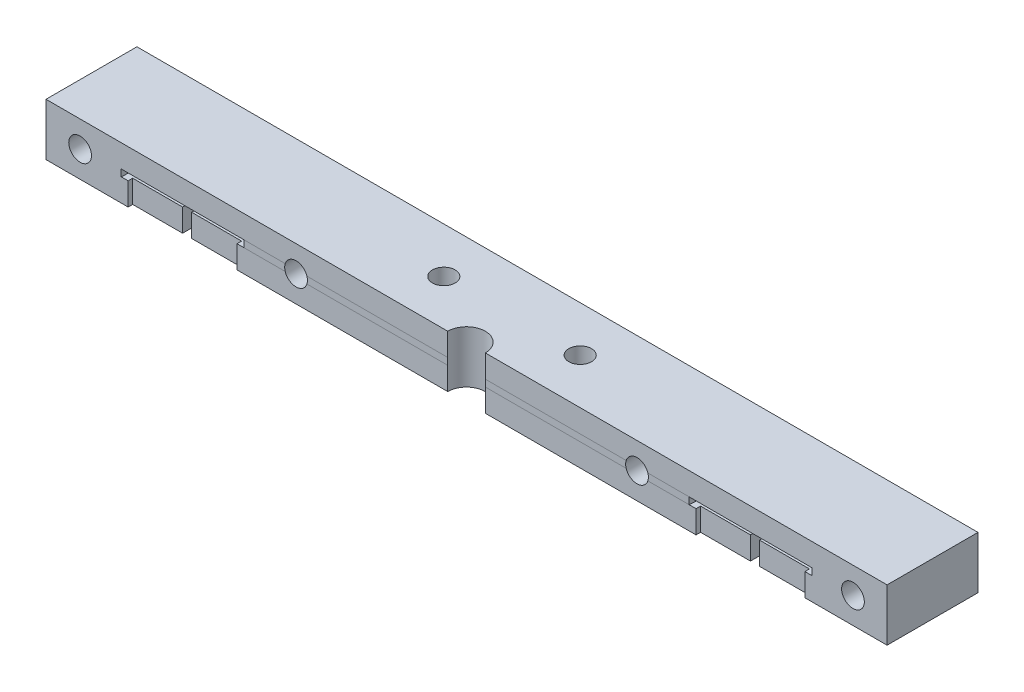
from build123d import *

# Parameters (mm, degrees)
BOSS_EXTRUDE1_DEPTH = 6.35
BOSS_EXTRUDE2_DEPTH = 1.905
SKETCH3_W           = 234.95
SKETCH3_H           = 25.4
BOSS_EXTRUDE4_DEPTH = 6.35
SKETCH4_R           = 3.175
CUT_EXTRUDE1_DEPTH  = 1183.689932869
SKETCH5_R           = 5.25
CUT_EXTRUDE2_DEPTH  = 1412.284370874
SKETCH8_R           = 3.175
CUT_EXTRUDE4_DEPTH  = 1183.68993125
SKETCH9_R           = 3.175
CUT_EXTRUDE5_DEPTH  = 1412.284302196


with BuildPart() as part:
    # Sketch1 → Boss-Extrude1 (new body)
    with BuildSketch(Plane.XZ.offset(-1022.109723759)):
        Polygon((368.049943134, 1286.487114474), (368.049943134, 1285.217114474), (381.988193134, 1285.217114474), (381.988193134, 1271.278864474), (384.528193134, 1271.278864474), (384.528193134, 1285.217114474), (398.466443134, 1285.217114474), (398.466443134, 1286.487114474), (462.575693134, 1286.488034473), (526.684943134, 1286.487114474), (526.684943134, 1285.217114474), (540.623193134, 1285.217114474), (540.623193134, 1271.278864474), (543.163193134, 1271.278864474), (543.163193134, 1285.217114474), (557.101443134, 1285.217114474), (557.101443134, 1286.487114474), (580.050693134, 1286.487114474), (580.050693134, 1261.087114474), (345.100693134, 1261.087114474), (345.100693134, 1286.487114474), align=None)
    extrude(amount=BOSS_EXTRUDE1_DEPTH)

    # Sketch2 → Boss-Extrude2 (add)
    with BuildSketch(Plane(origin=(0, 1022.109723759, 0), x_dir=(1, 0, 0), z_dir=(0, 1, 0))):
        with BuildLine():
            Line((366.113193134, -1286.487114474), (345.100693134, -1286.487114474))
            Line((345.100693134, -1286.487114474), (345.100693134, -1261.087114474))
            Line((345.100693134, -1261.087114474), (580.050693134, -1261.087114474))
            Line((580.050693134, -1261.087114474), (580.050693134, -1286.487114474))
            Line((580.050693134, -1286.487114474), (559.038193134, -1286.487114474))
            ThreePointArc((559.038193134, -1286.487114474), (541.893193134, -1269.342114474), (524.748193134, -1286.487114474))
            Line((524.748193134, -1286.487114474), (462.575693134, -1286.488034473))
            Line((462.575693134, -1286.488034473), (400.403193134, -1286.487114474))
            ThreePointArc((400.403193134, -1286.487114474), (383.258193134, -1269.342114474), (366.113193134, -1286.487114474))
        make_face()
    extrude(amount=BOSS_EXTRUDE2_DEPTH)

    # Sketch3 → Boss-Extrude4 (add)
    with BuildSketch(Plane(origin=(0, 1024.014723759, 0), x_dir=(1, 0, 0), z_dir=(0, 1, 0))):
        with Locations((462.575693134, -1273.787114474)):
            Rectangle(SKETCH3_W, SKETCH3_H)
    extrude(amount=BOSS_EXTRUDE4_DEPTH)

    # Sketch4 → Cut-Extrude1 (cut, through all)
    with BuildSketch(Plane(origin=(0, 0, 1261.087114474), x_dir=(-1, 0, 0), z_dir=(0, 0, -1))):
        with Locations(Location((-570.525693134, 1023.062223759, 0), (0, 0, 90))):
            Circle(SKETCH4_R)
        with Locations(Location((-354.625693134, 1023.062223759, 0), (0, 0, 90))):
            Circle(SKETCH4_R)
    extrude(amount=-CUT_EXTRUDE1_DEPTH, mode=Mode.SUBTRACT)

    # Sketch5 → Cut-Extrude2 (cut, through all)
    with BuildSketch(Plane.XZ.offset(-1015.759723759)):
        with Locations((462.575693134, 1286.488034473)):
            Circle(SKETCH5_R)
    extrude(amount=-CUT_EXTRUDE2_DEPTH, mode=Mode.SUBTRACT)

    # Sketch8 → Cut-Extrude4 (cut, through all)
    with BuildSketch(Plane(origin=(0, 0, 1261.087114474), x_dir=(-1, 0, 0), z_dir=(0, 0, -1))):
        with Locations(Location((-510.200693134, 1023.062223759, 0), (0, 0, 90))):
            Circle(SKETCH8_R)
        with Locations(Location((-414.950693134, 1023.062223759, 0), (0, 0, 90))):
            Circle(SKETCH8_R)
    extrude(amount=-CUT_EXTRUDE4_DEPTH, mode=Mode.SUBTRACT)

    # Sketch9 → Cut-Extrude5 (cut, through all)
    with BuildSketch(Plane.XZ.offset(-1015.759723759)):
        with Locations(Location((443.525693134, 1273.788034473, 0), (0, 0, 270))):
            Circle(SKETCH9_R)
        with Locations(Location((481.625693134, 1273.788034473, 0), (0, 0, 270))):
            Circle(SKETCH9_R)
    extrude(amount=-CUT_EXTRUDE5_DEPTH, mode=Mode.SUBTRACT)


solid = part.part
